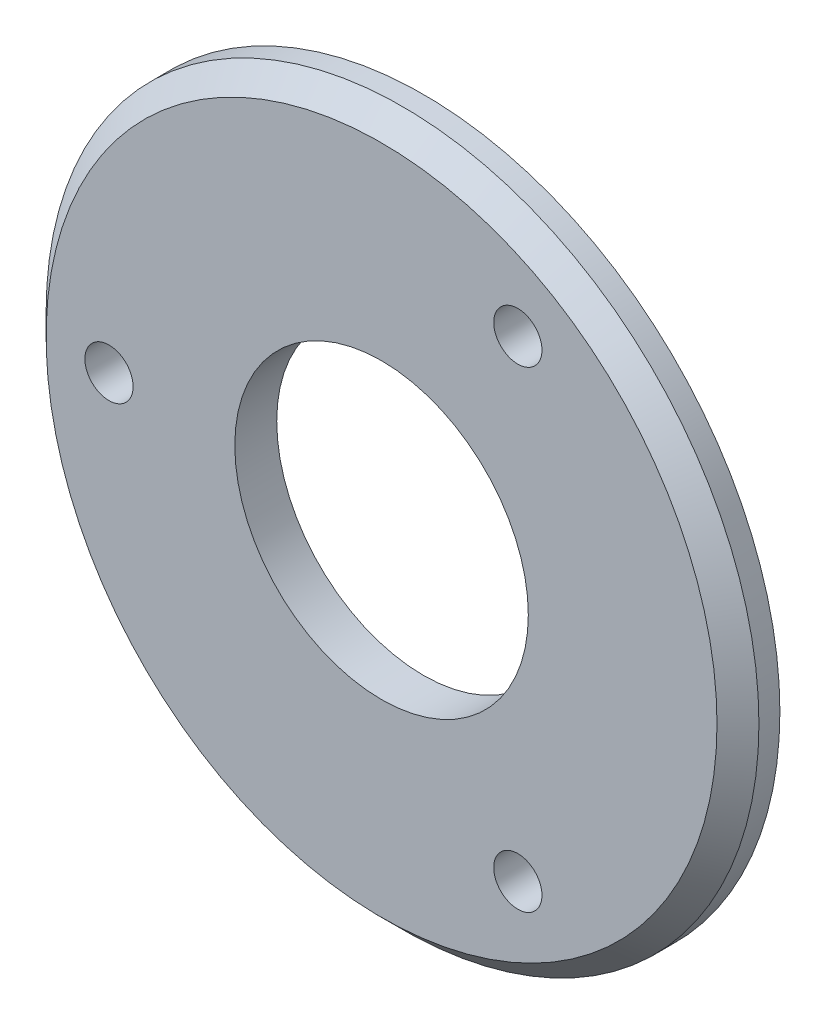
ISO-10303-21;
HEADER;
FILE_DESCRIPTION(('STEP AP214'),'2;1');
FILE_NAME('part.step','',(''),(''),'','','');
FILE_SCHEMA(('AUTOMOTIVE_DESIGN { 1 0 10303 214 1 1 1 1 }'));
ENDSEC;
DATA;
#1=APPLICATION_CONTEXT('core data for automotive mechanical design processes');
#2=APPLICATION_PROTOCOL_DEFINITION('international standard','automotive_design',2000,#1);
#3=PRODUCT_CONTEXT('',#1,'mechanical');
#4=PRODUCT('Part','Part','',(#3));
#5=PRODUCT_RELATED_PRODUCT_CATEGORY('part','',(#4));
#6=PRODUCT_DEFINITION_FORMATION('','',#4);
#7=PRODUCT_DEFINITION_CONTEXT('part definition',#1,'design');
#8=PRODUCT_DEFINITION('design','',#6,#7);
#9=PRODUCT_DEFINITION_SHAPE('','',#8);
#10=(LENGTH_UNIT() NAMED_UNIT(*) SI_UNIT(.MILLI.,.METRE.));
#11=(NAMED_UNIT(*) PLANE_ANGLE_UNIT() SI_UNIT($,.RADIAN.));
#12=(NAMED_UNIT(*) SI_UNIT($,.STERADIAN.) SOLID_ANGLE_UNIT());
#13=UNCERTAINTY_MEASURE_WITH_UNIT(LENGTH_MEASURE(1.E-05),#10,'distance_accuracy_value','');
#14=(GEOMETRIC_REPRESENTATION_CONTEXT(3) GLOBAL_UNCERTAINTY_ASSIGNED_CONTEXT((#13)) GLOBAL_UNIT_ASSIGNED_CONTEXT((#10,
#11,#12)) REPRESENTATION_CONTEXT('',''));
#15=CARTESIAN_POINT('',(0.,0.,0.));
#16=DIRECTION('',(0.,0.,1.));
#17=DIRECTION('',(1.,0.,0.));
#18=AXIS2_PLACEMENT_3D('',#15,#16,#17);
#19=CARTESIAN_POINT('',(0.,0.,10.));
#20=DIRECTION('',(0.,0.,1.));
#21=DIRECTION('',(1.,0.,0.));
#22=AXIS2_PLACEMENT_3D('',#19,#20,#21);
#23=PLANE('',#22);
#24=CARTESIAN_POINT('',(0.,0.,10.));
#25=DIRECTION('',(0.,0.,1.));
#26=DIRECTION('',(1.,0.,0.));
#27=AXIS2_PLACEMENT_3D('',#24,#25,#26);
#28=CIRCLE('',#27,80.);
#29=CARTESIAN_POINT('',(80.,0.,10.));
#30=VERTEX_POINT('',#29);
#31=EDGE_CURVE('E37',#30,#30,#28,.T.);
#32=ORIENTED_EDGE('',*,*,#31,.T.);
#33=EDGE_LOOP('',(#32));
#34=FACE_BOUND('',#33,.T.);
#35=CARTESIAN_POINT('',(-65.,4.33680868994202E-13,10.));
#36=DIRECTION('',(0.,0.,1.));
#37=DIRECTION('',(-0.499999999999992,0.866025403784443,0.));
#38=AXIS2_PLACEMENT_3D('',#35,#36,#37);
#39=CIRCLE('',#38,5.74999999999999);
#40=CARTESIAN_POINT('',(-67.8749999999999,4.97964607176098,10.));
#41=VERTEX_POINT('',#40);
#42=EDGE_CURVE('E68',#41,#41,#39,.T.);
#43=ORIENTED_EDGE('',*,*,#42,.F.);
#44=EDGE_LOOP('',(#43));
#45=FACE_BOUND('',#44,.T.);
#46=CARTESIAN_POINT('',(32.4999999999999,-56.2916512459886,10.));
#47=DIRECTION('',(0.,0.,1.));
#48=DIRECTION('',(-0.500000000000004,-0.866025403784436,0.));
#49=AXIS2_PLACEMENT_3D('',#46,#47,#48);
#50=CIRCLE('',#49,5.74999999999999);
#51=CARTESIAN_POINT('',(29.6249999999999,-61.2712973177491,10.));
#52=VERTEX_POINT('',#51);
#53=EDGE_CURVE('E62',#52,#52,#50,.T.);
#54=ORIENTED_EDGE('',*,*,#53,.F.);
#55=EDGE_LOOP('',(#54));
#56=FACE_BOUND('',#55,.T.);
#57=CARTESIAN_POINT('',(32.4999999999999,56.2916512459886,10.));
#58=DIRECTION('',(0.,0.,1.));
#59=DIRECTION('',(1.,0.,0.));
#60=AXIS2_PLACEMENT_3D('',#57,#58,#59);
#61=CIRCLE('',#60,5.74999999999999);
#62=CARTESIAN_POINT('',(38.2499999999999,56.2916512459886,10.));
#63=VERTEX_POINT('',#62);
#64=EDGE_CURVE('E56',#63,#63,#61,.T.);
#65=ORIENTED_EDGE('',*,*,#64,.F.);
#66=EDGE_LOOP('',(#65));
#67=FACE_BOUND('',#66,.T.);
#68=CARTESIAN_POINT('',(0.,0.,10.));
#69=DIRECTION('',(0.,0.,1.));
#70=DIRECTION('',(1.,0.,0.));
#71=AXIS2_PLACEMENT_3D('',#68,#69,#70);
#72=CIRCLE('',#71,35.);
#73=CARTESIAN_POINT('',(35.,0.,10.));
#74=VERTEX_POINT('',#73);
#75=EDGE_CURVE('E45',#74,#74,#72,.T.);
#76=ORIENTED_EDGE('',*,*,#75,.F.);
#77=EDGE_LOOP('',(#76));
#78=FACE_BOUND('',#77,.T.);
#79=ADVANCED_FACE('F30',(#34,#45,#56,#67,#78),#23,.T.);
#80=CARTESIAN_POINT('',(0.,0.,0.));
#81=DIRECTION('',(0.,0.,1.));
#82=DIRECTION('',(1.,0.,0.));
#83=AXIS2_PLACEMENT_3D('',#80,#81,#82);
#84=PLANE('',#83);
#85=CARTESIAN_POINT('',(-65.,4.33680868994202E-13,0.));
#86=DIRECTION('',(0.,0.,1.));
#87=DIRECTION('',(1.,0.,0.));
#88=AXIS2_PLACEMENT_3D('',#85,#86,#87);
#89=CIRCLE('',#88,5.74999999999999);
#90=CARTESIAN_POINT('',(-59.25,4.33680868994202E-13,0.));
#91=VERTEX_POINT('',#90);
#92=EDGE_CURVE('E65',#91,#91,#89,.F.);
#93=ORIENTED_EDGE('',*,*,#92,.F.);
#94=EDGE_LOOP('',(#93));
#95=FACE_BOUND('',#94,.T.);
#96=CARTESIAN_POINT('',(32.4999999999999,-56.2916512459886,0.));
#97=DIRECTION('',(0.,0.,1.));
#98=DIRECTION('',(1.,0.,0.));
#99=AXIS2_PLACEMENT_3D('',#96,#97,#98);
#100=CIRCLE('',#99,5.74999999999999);
#101=CARTESIAN_POINT('',(38.2499999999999,-56.2916512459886,0.));
#102=VERTEX_POINT('',#101);
#103=EDGE_CURVE('E59',#102,#102,#100,.F.);
#104=ORIENTED_EDGE('',*,*,#103,.F.);
#105=EDGE_LOOP('',(#104));
#106=FACE_BOUND('',#105,.T.);
#107=CARTESIAN_POINT('',(32.4999999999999,56.2916512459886,0.));
#108=DIRECTION('',(0.,0.,1.));
#109=DIRECTION('',(1.,0.,0.));
#110=AXIS2_PLACEMENT_3D('',#107,#108,#109);
#111=CIRCLE('',#110,5.74999999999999);
#112=CARTESIAN_POINT('',(38.2499999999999,56.2916512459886,0.));
#113=VERTEX_POINT('',#112);
#114=EDGE_CURVE('E51',#113,#113,#111,.F.);
#115=ORIENTED_EDGE('',*,*,#114,.F.);
#116=EDGE_LOOP('',(#115));
#117=FACE_BOUND('',#116,.T.);
#118=CARTESIAN_POINT('',(0.,0.,0.));
#119=DIRECTION('',(0.,0.,1.));
#120=DIRECTION('',(1.,0.,0.));
#121=AXIS2_PLACEMENT_3D('',#118,#119,#120);
#122=CIRCLE('',#121,85.);
#123=CARTESIAN_POINT('',(85.,0.,0.));
#124=VERTEX_POINT('',#123);
#125=EDGE_CURVE('E41',#124,#124,#122,.T.);
#126=ORIENTED_EDGE('',*,*,#125,.F.);
#127=EDGE_LOOP('',(#126));
#128=FACE_BOUND('',#127,.T.);
#129=CARTESIAN_POINT('',(0.,0.,0.));
#130=DIRECTION('',(0.,0.,1.));
#131=DIRECTION('',(1.,0.,0.));
#132=AXIS2_PLACEMENT_3D('',#129,#130,#131);
#133=CIRCLE('',#132,35.);
#134=CARTESIAN_POINT('',(35.,0.,0.));
#135=VERTEX_POINT('',#134);
#136=EDGE_CURVE('E48',#135,#135,#133,.T.);
#137=ORIENTED_EDGE('',*,*,#136,.T.);
#138=EDGE_LOOP('',(#137));
#139=FACE_BOUND('',#138,.T.);
#140=ADVANCED_FACE('F76',(#95,#106,#117,#128,#139),#84,.F.);
#141=CARTESIAN_POINT('',(0.,0.,10.));
#142=DIRECTION('',(0.,0.,-1.));
#143=DIRECTION('',(-1.,0.,0.));
#144=AXIS2_PLACEMENT_3D('',#141,#142,#143);
#145=CYLINDRICAL_SURFACE('',#144,85.);
#146=CARTESIAN_POINT('',(0.,0.,4.99999999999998));
#147=DIRECTION('',(0.,0.,1.));
#148=DIRECTION('',(1.,0.,0.));
#149=AXIS2_PLACEMENT_3D('',#146,#147,#148);
#150=CIRCLE('',#149,85.);
#151=CARTESIAN_POINT('',(85.,0.,4.99999999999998));
#152=VERTEX_POINT('',#151);
#153=EDGE_CURVE('E10',#152,#152,#150,.F.);
#154=ORIENTED_EDGE('',*,*,#153,.T.);
#155=EDGE_LOOP('',(#154));
#156=FACE_BOUND('',#155,.T.);
#157=ORIENTED_EDGE('',*,*,#125,.T.);
#158=EDGE_LOOP('',(#157));
#159=FACE_BOUND('',#158,.T.);
#160=ADVANCED_FACE('F88',(#156,#159),#145,.T.);
#161=CARTESIAN_POINT('',(0.,0.,10.));
#162=DIRECTION('',(0.,0.,-1.));
#163=DIRECTION('',(-1.,0.,0.));
#164=AXIS2_PLACEMENT_3D('',#161,#162,#163);
#165=CYLINDRICAL_SURFACE('',#164,35.);
#166=ORIENTED_EDGE('',*,*,#75,.T.);
#167=EDGE_LOOP('',(#166));
#168=FACE_BOUND('',#167,.T.);
#169=ORIENTED_EDGE('',*,*,#136,.F.);
#170=EDGE_LOOP('',(#169));
#171=FACE_BOUND('',#170,.T.);
#172=ADVANCED_FACE('F84',(#168,#171),#165,.F.);
#173=CARTESIAN_POINT('',(32.4999999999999,56.2916512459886,-16.2634559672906));
#174=DIRECTION('',(0.,0.,1.));
#175=DIRECTION('',(1.,0.,0.));
#176=AXIS2_PLACEMENT_3D('',#173,#174,#175);
#177=CYLINDRICAL_SURFACE('',#176,5.74999999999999);
#178=CARTESIAN_POINT('',(38.2499999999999,56.2916512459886,0.));
#179=CARTESIAN_POINT('',(38.2499999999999,56.2916512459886,0.104166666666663));
#180=CARTESIAN_POINT('',(38.2499999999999,56.2916512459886,0.20833333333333));
#181=CARTESIAN_POINT('',(38.2499999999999,56.2916512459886,0.416666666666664));
#182=CARTESIAN_POINT('',(38.2499999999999,56.2916512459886,0.52083333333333));
#183=CARTESIAN_POINT('',(38.2499999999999,56.2916512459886,0.729166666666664));
#184=CARTESIAN_POINT('',(38.2499999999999,56.2916512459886,0.833333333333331));
#185=CARTESIAN_POINT('',(38.2499999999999,56.2916512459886,1.04166666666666));
#186=CARTESIAN_POINT('',(38.2499999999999,56.2916512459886,1.14583333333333));
#187=CARTESIAN_POINT('',(38.2499999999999,56.2916512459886,1.35416666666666));
#188=CARTESIAN_POINT('',(38.2499999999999,56.2916512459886,1.45833333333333));
#189=CARTESIAN_POINT('',(38.2499999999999,56.2916512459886,1.66666666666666));
#190=CARTESIAN_POINT('',(38.2499999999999,56.2916512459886,1.77083333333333));
#191=CARTESIAN_POINT('',(38.2499999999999,56.2916512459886,1.97916666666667));
#192=CARTESIAN_POINT('',(38.2499999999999,56.2916512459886,2.08333333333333));
#193=CARTESIAN_POINT('',(38.2499999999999,56.2916512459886,2.29166666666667));
#194=CARTESIAN_POINT('',(38.2499999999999,56.2916512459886,2.39583333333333));
#195=CARTESIAN_POINT('',(38.2499999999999,56.2916512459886,2.60416666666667));
#196=CARTESIAN_POINT('',(38.2499999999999,56.2916512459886,2.70833333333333));
#197=CARTESIAN_POINT('',(38.2499999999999,56.2916512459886,2.91666666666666));
#198=CARTESIAN_POINT('',(38.2499999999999,56.2916512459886,3.02083333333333));
#199=CARTESIAN_POINT('',(38.2499999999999,56.2916512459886,3.22916666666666));
#200=CARTESIAN_POINT('',(38.2499999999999,56.2916512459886,3.33333333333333));
#201=CARTESIAN_POINT('',(38.2499999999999,56.2916512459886,3.54166666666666));
#202=CARTESIAN_POINT('',(38.2499999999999,56.2916512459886,3.64583333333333));
#203=CARTESIAN_POINT('',(38.2499999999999,56.2916512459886,3.85416666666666));
#204=CARTESIAN_POINT('',(38.2499999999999,56.2916512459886,3.95833333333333));
#205=CARTESIAN_POINT('',(38.2499999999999,56.2916512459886,4.16666666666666));
#206=CARTESIAN_POINT('',(38.2499999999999,56.2916512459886,4.27083333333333));
#207=CARTESIAN_POINT('',(38.2499999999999,56.2916512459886,4.47916666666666));
#208=CARTESIAN_POINT('',(38.2499999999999,56.2916512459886,4.58333333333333));
#209=CARTESIAN_POINT('',(38.2499999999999,56.2916512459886,4.79166666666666));
#210=CARTESIAN_POINT('',(38.2499999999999,56.2916512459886,4.89583333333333));
#211=CARTESIAN_POINT('',(38.2499999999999,56.2916512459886,5.10416666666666));
#212=CARTESIAN_POINT('',(38.2499999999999,56.2916512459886,5.20833333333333));
#213=CARTESIAN_POINT('',(38.2499999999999,56.2916512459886,5.41666666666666));
#214=CARTESIAN_POINT('',(38.2499999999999,56.2916512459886,5.52083333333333));
#215=CARTESIAN_POINT('',(38.2499999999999,56.2916512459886,5.72916666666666));
#216=CARTESIAN_POINT('',(38.2499999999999,56.2916512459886,5.83333333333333));
#217=CARTESIAN_POINT('',(38.2499999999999,56.2916512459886,6.04166666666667));
#218=CARTESIAN_POINT('',(38.2499999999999,56.2916512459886,6.14583333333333));
#219=CARTESIAN_POINT('',(38.2499999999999,56.2916512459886,6.35416666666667));
#220=CARTESIAN_POINT('',(38.2499999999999,56.2916512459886,6.45833333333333));
#221=CARTESIAN_POINT('',(38.2499999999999,56.2916512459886,6.66666666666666));
#222=CARTESIAN_POINT('',(38.2499999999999,56.2916512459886,6.77083333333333));
#223=CARTESIAN_POINT('',(38.2499999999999,56.2916512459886,6.97916666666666));
#224=CARTESIAN_POINT('',(38.2499999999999,56.2916512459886,7.08333333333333));
#225=CARTESIAN_POINT('',(38.2499999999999,56.2916512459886,7.29166666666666));
#226=CARTESIAN_POINT('',(38.2499999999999,56.2916512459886,7.39583333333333));
#227=CARTESIAN_POINT('',(38.2499999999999,56.2916512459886,7.60416666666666));
#228=CARTESIAN_POINT('',(38.2499999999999,56.2916512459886,7.70833333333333));
#229=CARTESIAN_POINT('',(38.2499999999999,56.2916512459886,7.91666666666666));
#230=CARTESIAN_POINT('',(38.2499999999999,56.2916512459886,8.02083333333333));
#231=CARTESIAN_POINT('',(38.2499999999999,56.2916512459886,8.22916666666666));
#232=CARTESIAN_POINT('',(38.2499999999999,56.2916512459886,8.33333333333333));
#233=CARTESIAN_POINT('',(38.2499999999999,56.2916512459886,8.54166666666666));
#234=CARTESIAN_POINT('',(38.2499999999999,56.2916512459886,8.64583333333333));
#235=CARTESIAN_POINT('',(38.2499999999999,56.2916512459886,8.85416666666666));
#236=CARTESIAN_POINT('',(38.2499999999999,56.2916512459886,8.95833333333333));
#237=CARTESIAN_POINT('',(38.2499999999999,56.2916512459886,9.16666666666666));
#238=CARTESIAN_POINT('',(38.2499999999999,56.2916512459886,9.27083333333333));
#239=CARTESIAN_POINT('',(38.2499999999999,56.2916512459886,9.47916666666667));
#240=CARTESIAN_POINT('',(38.2499999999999,56.2916512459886,9.58333333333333));
#241=CARTESIAN_POINT('',(38.2499999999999,56.2916512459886,9.79166666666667));
#242=CARTESIAN_POINT('',(38.2499999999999,56.2916512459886,9.89583333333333));
#243=CARTESIAN_POINT('',(38.2499999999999,56.2916512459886,10.));
#244=B_SPLINE_CURVE_WITH_KNOTS('',3,(#178,#179,#180,#181,#182,#183,#184,#185,#186,#187,#188,
#189,#190,#191,#192,#193,#194,#195,#196,#197,#198,#199,#200,#201,#202,#203,#204,#205,#206,#207,
#208,#209,#210,#211,#212,#213,#214,#215,#216,#217,#218,#219,#220,#221,#222,#223,#224,#225,#226,
#227,#228,#229,#230,#231,#232,#233,#234,#235,#236,#237,#238,#239,#240,#241,#242,#243),
.UNSPECIFIED.,.F.,.F.,(4,2,2,2,2,2,2,2,2,2,2,2,2,2,2,2,2,2,2,2,2,2,2,2,2,2,2,2,2,2,2,2,4),(0.,
0.3125,0.625000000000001,0.937500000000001,1.25,1.5625,1.875,2.1875,2.5,2.8125,3.125,3.4375,
3.75,4.0625,4.375,4.6875,5.,5.3125,5.625,5.9375,6.25,6.5625,6.875,7.1875,7.5,7.8125,8.125,
8.4375,8.75,9.0625,9.375,9.6875,10.),.UNSPECIFIED.);
#245=EDGE_CURVE('BSEAM87',#113,#63,#244,.T.);
#246=ORIENTED_EDGE('',*,*,#114,.T.);
#247=ORIENTED_EDGE('',*,*,#64,.T.);
#248=ORIENTED_EDGE('',*,*,#245,.T.);
#249=ORIENTED_EDGE('',*,*,#245,.F.);
#250=EDGE_LOOP('',(#246,#248,#247,#249));
#251=FACE_BOUND('',#250,.T.);
#252=ADVANCED_FACE('F87',(#251),#177,.F.);
#253=CARTESIAN_POINT('',(32.4999999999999,-56.2916512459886,-16.2634559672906));
#254=DIRECTION('',(0.,0.,1.));
#255=DIRECTION('',(1.,0.,0.));
#256=AXIS2_PLACEMENT_3D('',#253,#254,#255);
#257=CYLINDRICAL_SURFACE('',#256,5.74999999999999);
#258=ORIENTED_EDGE('',*,*,#103,.T.);
#259=EDGE_LOOP('',(#258));
#260=FACE_BOUND('',#259,.T.);
#261=ORIENTED_EDGE('',*,*,#53,.T.);
#262=EDGE_LOOP('',(#261));
#263=FACE_BOUND('',#262,.T.);
#264=ADVANCED_FACE('F103',(#260,#263),#257,.F.);
#265=CARTESIAN_POINT('',(-65.,4.33680868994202E-13,-16.2634559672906));
#266=DIRECTION('',(0.,0.,1.));
#267=DIRECTION('',(1.,0.,0.));
#268=AXIS2_PLACEMENT_3D('',#265,#266,#267);
#269=CYLINDRICAL_SURFACE('',#268,5.74999999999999);
#270=ORIENTED_EDGE('',*,*,#92,.T.);
#271=EDGE_LOOP('',(#270));
#272=FACE_BOUND('',#271,.T.);
#273=ORIENTED_EDGE('',*,*,#42,.T.);
#274=EDGE_LOOP('',(#273));
#275=FACE_BOUND('',#274,.T.);
#276=ADVANCED_FACE('F72',(#272,#275),#269,.F.);
#277=CARTESIAN_POINT('',(0.,0.,10.));
#278=DIRECTION('',(0.,0.,-1.));
#279=DIRECTION('',(-1.,0.,0.));
#280=AXIS2_PLACEMENT_3D('',#277,#278,#279);
#281=CONICAL_SURFACE('',#280,80.,0.78539816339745);
#282=ORIENTED_EDGE('',*,*,#153,.F.);
#283=EDGE_LOOP('',(#282));
#284=FACE_BOUND('',#283,.T.);
#285=ORIENTED_EDGE('',*,*,#31,.F.);
#286=EDGE_LOOP('',(#285));
#287=FACE_BOUND('',#286,.T.);
#288=ADVANCED_FACE('F32',(#284,#287),#281,.T.);
#289=CLOSED_SHELL('',(#79,#140,#160,#172,#252,#264,#276,#288));
#290=MANIFOLD_SOLID_BREP('B2',#289);
#291=ADVANCED_BREP_SHAPE_REPRESENTATION('',(#18,#290),#14);
#292=SHAPE_DEFINITION_REPRESENTATION(#9,#291);
ENDSEC;
END-ISO-10303-21;
